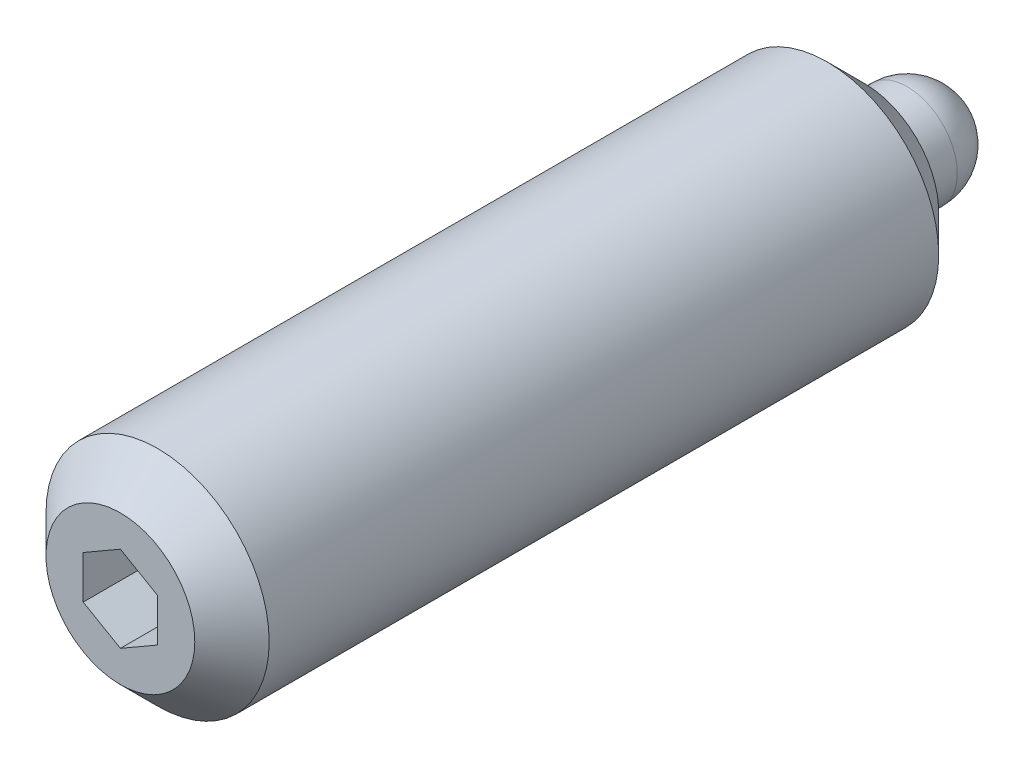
ISO-10303-21;
HEADER;
FILE_DESCRIPTION(('STEP AP214'),'2;1');
FILE_NAME('part.step','',(''),(''),'','','');
FILE_SCHEMA(('AUTOMOTIVE_DESIGN { 1 0 10303 214 1 1 1 1 }'));
ENDSEC;
DATA;
#1=APPLICATION_CONTEXT('core data for automotive mechanical design processes');
#2=APPLICATION_PROTOCOL_DEFINITION('international standard','automotive_design',2000,#1);
#3=PRODUCT_CONTEXT('',#1,'mechanical');
#4=PRODUCT('Part','Part','',(#3));
#5=PRODUCT_RELATED_PRODUCT_CATEGORY('part','',(#4));
#6=PRODUCT_DEFINITION_FORMATION('','',#4);
#7=PRODUCT_DEFINITION_CONTEXT('part definition',#1,'design');
#8=PRODUCT_DEFINITION('design','',#6,#7);
#9=PRODUCT_DEFINITION_SHAPE('','',#8);
#10=(LENGTH_UNIT() NAMED_UNIT(*) SI_UNIT(.MILLI.,.METRE.));
#11=(NAMED_UNIT(*) PLANE_ANGLE_UNIT() SI_UNIT($,.RADIAN.));
#12=(NAMED_UNIT(*) SI_UNIT($,.STERADIAN.) SOLID_ANGLE_UNIT());
#13=UNCERTAINTY_MEASURE_WITH_UNIT(LENGTH_MEASURE(1.E-05),#10,'distance_accuracy_value','');
#14=(GEOMETRIC_REPRESENTATION_CONTEXT(3) GLOBAL_UNCERTAINTY_ASSIGNED_CONTEXT((#13)) GLOBAL_UNIT_ASSIGNED_CONTEXT((#10,
#11,#12)) REPRESENTATION_CONTEXT('',''));
#15=CARTESIAN_POINT('',(0.,0.,0.));
#16=DIRECTION('',(0.,0.,1.));
#17=DIRECTION('',(1.,0.,0.));
#18=AXIS2_PLACEMENT_3D('',#15,#16,#17);
#19=CARTESIAN_POINT('',(0.,3.,22.5));
#20=DIRECTION('',(0.,0.,1.));
#21=DIRECTION('',(1.,0.,0.));
#22=AXIS2_PLACEMENT_3D('',#19,#20,#21);
#23=PLANE('',#22);
#24=CARTESIAN_POINT('',(0.,0.,22.5));
#25=DIRECTION('',(0.,0.,1.));
#26=DIRECTION('',(1.,0.,0.));
#27=AXIS2_PLACEMENT_3D('',#24,#25,#26);
#28=CIRCLE('',#27,2.);
#29=CARTESIAN_POINT('',(2.,0.,22.5));
#30=VERTEX_POINT('',#29);
#31=EDGE_CURVE('E9',#30,#30,#28,.T.);
#32=ORIENTED_EDGE('',*,*,#31,.T.);
#33=EDGE_LOOP('',(#32));
#34=FACE_BOUND('',#33,.T.);
#35=DIRECTION('',(0.866025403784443,-0.499999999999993,0.));
#36=VECTOR('',#35,1.);
#37=CARTESIAN_POINT('',(-1.,-0.577350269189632,22.5));
#38=LINE('',#37,#36);
#39=CARTESIAN_POINT('',(-1.,-0.577350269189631,22.5));
#40=VERTEX_POINT('',#39);
#41=CARTESIAN_POINT('',(0.,-1.15470053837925,22.5));
#42=VERTEX_POINT('',#41);
#43=EDGE_CURVE('E84',#40,#42,#38,.T.);
#44=ORIENTED_EDGE('',*,*,#43,.F.);
#45=DIRECTION('',(0.,1.,0.));
#46=VECTOR('',#45,1.);
#47=CARTESIAN_POINT('',(-1.,-0.577350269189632,22.5));
#48=LINE('',#47,#46);
#49=CARTESIAN_POINT('',(-1.,0.577350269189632,22.5));
#50=VERTEX_POINT('',#49);
#51=EDGE_CURVE('E29',#40,#50,#48,.T.);
#52=ORIENTED_EDGE('',*,*,#51,.T.);
#53=DIRECTION('',(0.866025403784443,0.499999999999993,0.));
#54=VECTOR('',#53,1.);
#55=CARTESIAN_POINT('',(-1.,0.577350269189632,22.5));
#56=LINE('',#55,#54);
#57=CARTESIAN_POINT('',(0.,1.15470053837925,22.5));
#58=VERTEX_POINT('',#57);
#59=EDGE_CURVE('E74',#50,#58,#56,.T.);
#60=ORIENTED_EDGE('',*,*,#59,.T.);
#61=DIRECTION('',(-0.866025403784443,0.499999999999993,0.));
#62=VECTOR('',#61,1.);
#63=CARTESIAN_POINT('',(1.,0.577350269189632,22.5));
#64=LINE('',#63,#62);
#65=CARTESIAN_POINT('',(1.,0.577350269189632,22.5));
#66=VERTEX_POINT('',#65);
#67=EDGE_CURVE('E79',#66,#58,#64,.T.);
#68=ORIENTED_EDGE('',*,*,#67,.F.);
#69=DIRECTION('',(0.,1.,0.));
#70=VECTOR('',#69,1.);
#71=CARTESIAN_POINT('',(1.,-0.577350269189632,22.5));
#72=LINE('',#71,#70);
#73=CARTESIAN_POINT('',(1.,-0.577350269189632,22.5));
#74=VERTEX_POINT('',#73);
#75=EDGE_CURVE('E88',#74,#66,#72,.T.);
#76=ORIENTED_EDGE('',*,*,#75,.F.);
#77=DIRECTION('',(-0.866025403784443,-0.499999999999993,0.));
#78=VECTOR('',#77,1.);
#79=CARTESIAN_POINT('',(1.,-0.577350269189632,22.5));
#80=LINE('',#79,#78);
#81=EDGE_CURVE('E91',#74,#42,#80,.T.);
#82=ORIENTED_EDGE('',*,*,#81,.T.);
#83=EDGE_LOOP('',(#44,#52,#60,#68,#76,#82));
#84=FACE_BOUND('',#83,.T.);
#85=ADVANCED_FACE('F14',(#34,#84),#23,.T.);
#86=CARTESIAN_POINT('',(0.,0.,1.35));
#87=DIRECTION('',(-1.,0.,0.));
#88=DIRECTION('',(0.,0.,1.));
#89=AXIS2_PLACEMENT_3D('',#86,#87,#88);
#90=SPHERICAL_SURFACE('',#89,1.35);
#91=CARTESIAN_POINT('',(0.,0.,1.35));
#92=DIRECTION('',(0.,0.,-1.));
#93=DIRECTION('',(-1.,0.,0.));
#94=AXIS2_PLACEMENT_3D('',#91,#92,#93);
#95=SPHERICAL_SURFACE('',#94,1.35);
#96=CARTESIAN_POINT('',(0.,0.,1.35));
#97=DIRECTION('',(0.,0.,-1.));
#98=DIRECTION('',(-1.,0.,0.));
#99=AXIS2_PLACEMENT_3D('',#96,#97,#98);
#100=CIRCLE('',#99,1.35);
#101=CARTESIAN_POINT('',(-1.35,0.,1.35));
#102=VERTEX_POINT('',#101);
#103=EDGE_CURVE('E70',#102,#102,#100,.T.);
#104=ORIENTED_EDGE('',*,*,#103,.T.);
#105=EDGE_LOOP('',(#104));
#106=FACE_BOUND('',#105,.T.);
#107=ADVANCED_FACE('F152',(#106),#95,.T.);
#108=CARTESIAN_POINT('',(0.,0.,-3.5));
#109=DIRECTION('',(0.,0.,-1.));
#110=DIRECTION('',(-1.,0.,0.));
#111=AXIS2_PLACEMENT_3D('',#108,#109,#110);
#112=CYLINDRICAL_SURFACE('',#111,3.);
#113=CARTESIAN_POINT('',(0.,0.,3.5));
#114=DIRECTION('',(0.,0.,-1.));
#115=DIRECTION('',(-1.,0.,0.));
#116=AXIS2_PLACEMENT_3D('',#113,#114,#115);
#117=CIRCLE('',#116,3.);
#118=CARTESIAN_POINT('',(-3.,0.,3.5));
#119=VERTEX_POINT('',#118);
#120=EDGE_CURVE('E22',#119,#119,#117,.F.);
#121=ORIENTED_EDGE('',*,*,#120,.T.);
#122=EDGE_LOOP('',(#121));
#123=FACE_BOUND('',#122,.T.);
#124=CARTESIAN_POINT('',(0.,0.,21.5));
#125=DIRECTION('',(0.,0.,1.));
#126=DIRECTION('',(1.,0.,0.));
#127=AXIS2_PLACEMENT_3D('',#124,#125,#126);
#128=CIRCLE('',#127,3.);
#129=CARTESIAN_POINT('',(3.,0.,21.5));
#130=VERTEX_POINT('',#129);
#131=EDGE_CURVE('E125',#130,#130,#128,.F.);
#132=ORIENTED_EDGE('',*,*,#131,.T.);
#133=EDGE_LOOP('',(#132));
#134=FACE_BOUND('',#133,.T.);
#135=ADVANCED_FACE('F130',(#123,#134),#112,.T.);
#136=CARTESIAN_POINT('',(0.,1.35,2.5));
#137=DIRECTION('',(0.,0.,-1.));
#138=DIRECTION('',(-1.,0.,0.));
#139=AXIS2_PLACEMENT_3D('',#136,#137,#138);
#140=PLANE('',#139);
#141=CARTESIAN_POINT('',(0.,0.,2.5));
#142=DIRECTION('',(0.,0.,-1.));
#143=DIRECTION('',(-1.,0.,0.));
#144=AXIS2_PLACEMENT_3D('',#141,#142,#143);
#145=CIRCLE('',#144,2.);
#146=CARTESIAN_POINT('',(-2.,0.,2.5));
#147=VERTEX_POINT('',#146);
#148=EDGE_CURVE('E122',#147,#147,#145,.T.);
#149=ORIENTED_EDGE('',*,*,#148,.T.);
#150=EDGE_LOOP('',(#149));
#151=FACE_BOUND('',#150,.T.);
#152=CARTESIAN_POINT('',(0.,0.,2.5));
#153=DIRECTION('',(0.,0.,-1.));
#154=DIRECTION('',(-1.,0.,0.));
#155=AXIS2_PLACEMENT_3D('',#152,#153,#154);
#156=CIRCLE('',#155,1.35);
#157=CARTESIAN_POINT('',(-1.35,0.,2.5));
#158=VERTEX_POINT('',#157);
#159=EDGE_CURVE('E119',#158,#158,#156,.T.);
#160=ORIENTED_EDGE('',*,*,#159,.F.);
#161=EDGE_LOOP('',(#160));
#162=FACE_BOUND('',#161,.T.);
#163=ADVANCED_FACE('F140',(#151,#162),#140,.T.);
#164=CARTESIAN_POINT('',(0.,0.,-3.5));
#165=DIRECTION('',(0.,0.,-1.));
#166=DIRECTION('',(-1.,0.,0.));
#167=AXIS2_PLACEMENT_3D('',#164,#165,#166);
#168=CYLINDRICAL_SURFACE('',#167,1.35);
#169=ORIENTED_EDGE('',*,*,#159,.T.);
#170=EDGE_LOOP('',(#169));
#171=FACE_BOUND('',#170,.T.);
#172=ORIENTED_EDGE('',*,*,#103,.F.);
#173=EDGE_LOOP('',(#172));
#174=FACE_BOUND('',#173,.T.);
#175=ADVANCED_FACE('F143',(#171,#174),#168,.T.);
#176=CARTESIAN_POINT('',(-1.,-0.577350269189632,20.));
#177=DIRECTION('',(1.,0.,0.));
#178=DIRECTION('',(0.,0.,-1.));
#179=AXIS2_PLACEMENT_3D('',#176,#177,#178);
#180=PLANE('',#179);
#181=DIRECTION('',(0.,0.,1.));
#182=VECTOR('',#181,1.);
#183=CARTESIAN_POINT('',(-1.,0.577350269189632,20.));
#184=LINE('',#183,#182);
#185=CARTESIAN_POINT('',(-1.,0.577350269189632,20.));
#186=VERTEX_POINT('',#185);
#187=EDGE_CURVE('E63',#186,#50,#184,.T.);
#188=ORIENTED_EDGE('',*,*,#187,.T.);
#189=ORIENTED_EDGE('',*,*,#51,.F.);
#190=DIRECTION('',(0.,0.,1.));
#191=VECTOR('',#190,1.);
#192=CARTESIAN_POINT('',(-1.,-0.577350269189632,20.));
#193=LINE('',#192,#191);
#194=CARTESIAN_POINT('',(-1.,-0.577350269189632,20.));
#195=VERTEX_POINT('',#194);
#196=EDGE_CURVE('E33',#195,#40,#193,.T.);
#197=ORIENTED_EDGE('',*,*,#196,.F.);
#198=DIRECTION('',(0.,1.,0.));
#199=VECTOR('',#198,1.);
#200=CARTESIAN_POINT('',(-1.,-0.577350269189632,20.));
#201=LINE('',#200,#199);
#202=EDGE_CURVE('E66',#195,#186,#201,.T.);
#203=ORIENTED_EDGE('',*,*,#202,.T.);
#204=EDGE_LOOP('',(#188,#189,#197,#203));
#205=FACE_BOUND('',#204,.T.);
#206=ADVANCED_FACE('F65',(#205),#180,.T.);
#207=CARTESIAN_POINT('',(-1.,0.577350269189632,20.));
#208=DIRECTION('',(0.499999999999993,-0.866025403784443,0.));
#209=DIRECTION('',(0.866025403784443,0.499999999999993,0.));
#210=AXIS2_PLACEMENT_3D('',#207,#208,#209);
#211=PLANE('',#210);
#212=DIRECTION('',(0.,0.,1.));
#213=VECTOR('',#212,1.);
#214=CARTESIAN_POINT('',(0.,1.15470053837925,20.));
#215=LINE('',#214,#213);
#216=CARTESIAN_POINT('',(0.,1.15470053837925,20.));
#217=VERTEX_POINT('',#216);
#218=EDGE_CURVE('E71',#217,#58,#215,.T.);
#219=ORIENTED_EDGE('',*,*,#218,.T.);
#220=ORIENTED_EDGE('',*,*,#59,.F.);
#221=ORIENTED_EDGE('',*,*,#187,.F.);
#222=DIRECTION('',(0.866025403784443,0.499999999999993,0.));
#223=VECTOR('',#222,1.);
#224=CARTESIAN_POINT('',(-1.,0.577350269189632,20.));
#225=LINE('',#224,#223);
#226=EDGE_CURVE('E95',#186,#217,#225,.T.);
#227=ORIENTED_EDGE('',*,*,#226,.T.);
#228=EDGE_LOOP('',(#219,#220,#221,#227));
#229=FACE_BOUND('',#228,.T.);
#230=ADVANCED_FACE('F75',(#229),#211,.T.);
#231=CARTESIAN_POINT('',(1.,0.577350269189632,20.));
#232=DIRECTION('',(0.499999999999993,0.866025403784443,0.));
#233=DIRECTION('',(-0.866025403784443,0.499999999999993,0.));
#234=AXIS2_PLACEMENT_3D('',#231,#232,#233);
#235=PLANE('',#234);
#236=DIRECTION('',(0.,0.,1.));
#237=VECTOR('',#236,1.);
#238=CARTESIAN_POINT('',(1.,0.577350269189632,20.));
#239=LINE('',#238,#237);
#240=CARTESIAN_POINT('',(1.,0.577350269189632,20.));
#241=VERTEX_POINT('',#240);
#242=EDGE_CURVE('E114',#241,#66,#239,.T.);
#243=ORIENTED_EDGE('',*,*,#242,.T.);
#244=ORIENTED_EDGE('',*,*,#67,.T.);
#245=ORIENTED_EDGE('',*,*,#218,.F.);
#246=DIRECTION('',(-0.866025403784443,0.499999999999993,0.));
#247=VECTOR('',#246,1.);
#248=CARTESIAN_POINT('',(1.,0.577350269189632,20.));
#249=LINE('',#248,#247);
#250=EDGE_CURVE('E97',#241,#217,#249,.T.);
#251=ORIENTED_EDGE('',*,*,#250,.F.);
#252=EDGE_LOOP('',(#243,#244,#245,#251));
#253=FACE_BOUND('',#252,.T.);
#254=ADVANCED_FACE('F166',(#253),#235,.F.);
#255=CARTESIAN_POINT('',(1.,-0.577350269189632,20.));
#256=DIRECTION('',(1.,0.,0.));
#257=DIRECTION('',(0.,0.,-1.));
#258=AXIS2_PLACEMENT_3D('',#255,#256,#257);
#259=PLANE('',#258);
#260=DIRECTION('',(0.,0.,1.));
#261=VECTOR('',#260,1.);
#262=CARTESIAN_POINT('',(1.,-0.577350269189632,20.));
#263=LINE('',#262,#261);
#264=CARTESIAN_POINT('',(1.,-0.577350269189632,20.));
#265=VERTEX_POINT('',#264);
#266=EDGE_CURVE('E112',#265,#74,#263,.T.);
#267=ORIENTED_EDGE('',*,*,#266,.T.);
#268=ORIENTED_EDGE('',*,*,#75,.T.);
#269=ORIENTED_EDGE('',*,*,#242,.F.);
#270=DIRECTION('',(0.,1.,0.));
#271=VECTOR('',#270,1.);
#272=CARTESIAN_POINT('',(1.,-0.577350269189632,20.));
#273=LINE('',#272,#271);
#274=EDGE_CURVE('E100',#265,#241,#273,.T.);
#275=ORIENTED_EDGE('',*,*,#274,.F.);
#276=EDGE_LOOP('',(#267,#268,#269,#275));
#277=FACE_BOUND('',#276,.T.);
#278=ADVANCED_FACE('F169',(#277),#259,.F.);
#279=CARTESIAN_POINT('',(1.,-0.577350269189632,20.));
#280=DIRECTION('',(-0.499999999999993,0.866025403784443,0.));
#281=DIRECTION('',(-0.866025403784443,-0.499999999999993,0.));
#282=AXIS2_PLACEMENT_3D('',#279,#280,#281);
#283=PLANE('',#282);
#284=DIRECTION('',(0.,0.,1.));
#285=VECTOR('',#284,1.);
#286=CARTESIAN_POINT('',(0.,-1.15470053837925,20.));
#287=LINE('',#286,#285);
#288=CARTESIAN_POINT('',(0.,-1.15470053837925,20.));
#289=VERTEX_POINT('',#288);
#290=EDGE_CURVE('E110',#289,#42,#287,.T.);
#291=ORIENTED_EDGE('',*,*,#290,.T.);
#292=ORIENTED_EDGE('',*,*,#81,.F.);
#293=ORIENTED_EDGE('',*,*,#266,.F.);
#294=DIRECTION('',(-0.866025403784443,-0.499999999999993,0.));
#295=VECTOR('',#294,1.);
#296=CARTESIAN_POINT('',(1.,-0.577350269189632,20.));
#297=LINE('',#296,#295);
#298=EDGE_CURVE('E103',#265,#289,#297,.T.);
#299=ORIENTED_EDGE('',*,*,#298,.T.);
#300=EDGE_LOOP('',(#291,#292,#293,#299));
#301=FACE_BOUND('',#300,.T.);
#302=ADVANCED_FACE('F173',(#301),#283,.T.);
#303=CARTESIAN_POINT('',(-1.,-0.577350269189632,20.));
#304=DIRECTION('',(-0.499999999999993,-0.866025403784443,0.));
#305=DIRECTION('',(0.866025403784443,-0.499999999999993,0.));
#306=AXIS2_PLACEMENT_3D('',#303,#304,#305);
#307=PLANE('',#306);
#308=DIRECTION('',(0.866025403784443,-0.499999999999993,0.));
#309=VECTOR('',#308,1.);
#310=CARTESIAN_POINT('',(-1.,-0.577350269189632,20.));
#311=LINE('',#310,#309);
#312=EDGE_CURVE('E106',#195,#289,#311,.T.);
#313=ORIENTED_EDGE('',*,*,#312,.F.);
#314=ORIENTED_EDGE('',*,*,#196,.T.);
#315=ORIENTED_EDGE('',*,*,#43,.T.);
#316=ORIENTED_EDGE('',*,*,#290,.F.);
#317=EDGE_LOOP('',(#313,#314,#315,#316));
#318=FACE_BOUND('',#317,.T.);
#319=ADVANCED_FACE('F137',(#318),#307,.F.);
#320=CARTESIAN_POINT('',(-1.,0.577350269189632,20.));
#321=DIRECTION('',(0.,0.,-1.));
#322=DIRECTION('',(-1.,0.,0.));
#323=AXIS2_PLACEMENT_3D('',#320,#321,#322);
#324=PLANE('',#323);
#325=ORIENTED_EDGE('',*,*,#202,.F.);
#326=ORIENTED_EDGE('',*,*,#312,.T.);
#327=ORIENTED_EDGE('',*,*,#298,.F.);
#328=ORIENTED_EDGE('',*,*,#274,.T.);
#329=ORIENTED_EDGE('',*,*,#250,.T.);
#330=ORIENTED_EDGE('',*,*,#226,.F.);
#331=EDGE_LOOP('',(#325,#326,#327,#328,#329,#330));
#332=FACE_BOUND('',#331,.T.);
#333=ADVANCED_FACE('F136',(#332),#324,.F.);
#334=CARTESIAN_POINT('',(0.,0.,2.5));
#335=DIRECTION('',(0.,0.,1.));
#336=DIRECTION('',(1.,0.,0.));
#337=AXIS2_PLACEMENT_3D('',#334,#335,#336);
#338=CONICAL_SURFACE('',#337,2.,0.785398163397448);
#339=ORIENTED_EDGE('',*,*,#120,.F.);
#340=EDGE_LOOP('',(#339));
#341=FACE_BOUND('',#340,.T.);
#342=ORIENTED_EDGE('',*,*,#148,.F.);
#343=EDGE_LOOP('',(#342));
#344=FACE_BOUND('',#343,.T.);
#345=ADVANCED_FACE('F133',(#341,#344),#338,.T.);
#346=CARTESIAN_POINT('',(0.,0.,21.5));
#347=DIRECTION('',(0.,0.,-1.));
#348=DIRECTION('',(-1.,0.,0.));
#349=AXIS2_PLACEMENT_3D('',#346,#347,#348);
#350=CONICAL_SURFACE('',#349,3.,0.785398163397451);
#351=ORIENTED_EDGE('',*,*,#31,.F.);
#352=EDGE_LOOP('',(#351));
#353=FACE_BOUND('',#352,.T.);
#354=ORIENTED_EDGE('',*,*,#131,.F.);
#355=EDGE_LOOP('',(#354));
#356=FACE_BOUND('',#355,.T.);
#357=ADVANCED_FACE('F16',(#353,#356),#350,.T.);
#358=CLOSED_SHELL('',(#85,#107,#135,#163,#175,#206,#230,#254,#278,#302,#319,#333,#345,#357));
#359=MANIFOLD_SOLID_BREP('B1',#358);
#360=ADVANCED_BREP_SHAPE_REPRESENTATION('',(#18,#359),#14);
#361=SHAPE_DEFINITION_REPRESENTATION(#9,#360);
ENDSEC;
END-ISO-10303-21;
